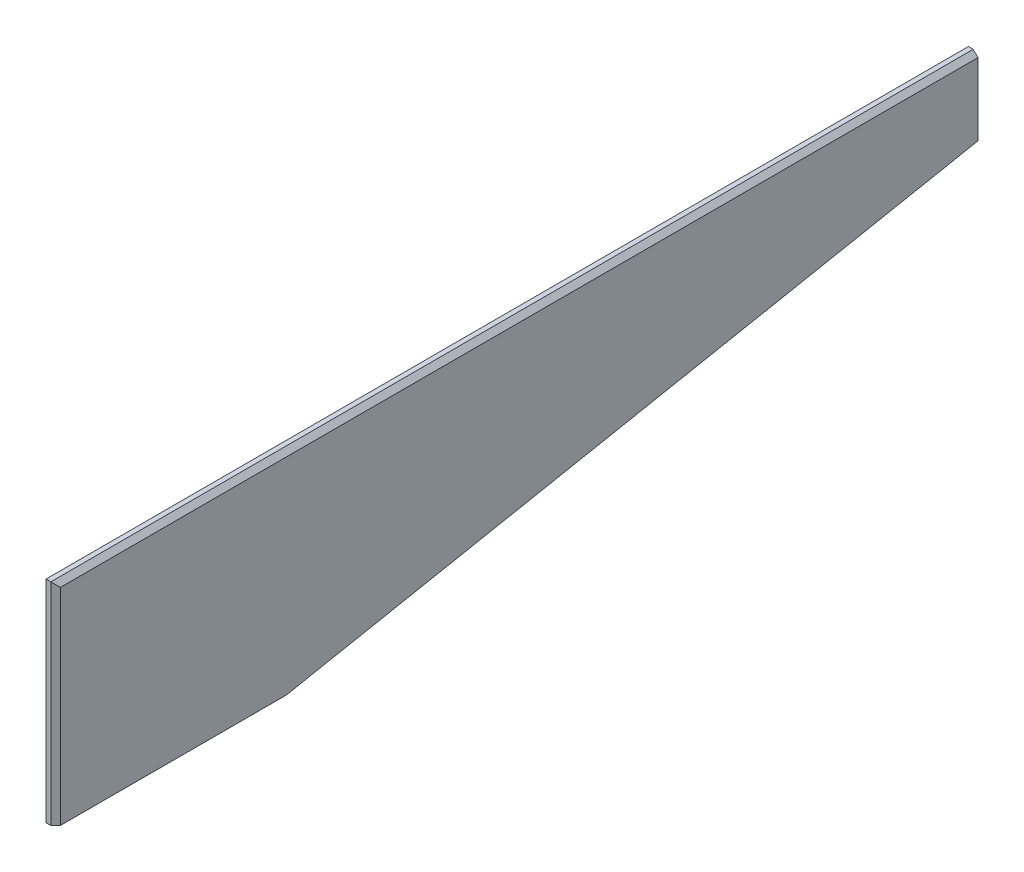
from build123d import *

# Parameters (mm, degrees)
BOSS_EXTRUDE4_DEPTH = 4.7625
CHAMFER3_SIZE       = 3.175


with BuildPart() as part:
    # Sketch5 → Boss-Extrude4 (new, symmetric)
    with BuildSketch(Plane.YZ):
        Polygon((69.723, -256.588187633), (69.723, -713.788187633), (18.923, -713.788187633), (-69.723, -256.588187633), (-69.723, -104.188187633), (69.723, -104.188187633), align=None)
    extrude(amount=BOSS_EXTRUDE4_DEPTH, both=True)

    # Chamfer3
    chamfer3_edges = [part.edges().sort_by_distance(p)[0] for p in [
        (4.7625, 69.723, -408.988187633),
        (4.7625, 0, -104.188187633),
        (-4.7625, 0, -104.188187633),
        (-4.7625, 69.723, -408.988187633),
    ]]
    chamfer(chamfer3_edges, length=CHAMFER3_SIZE)


solid = part.part
